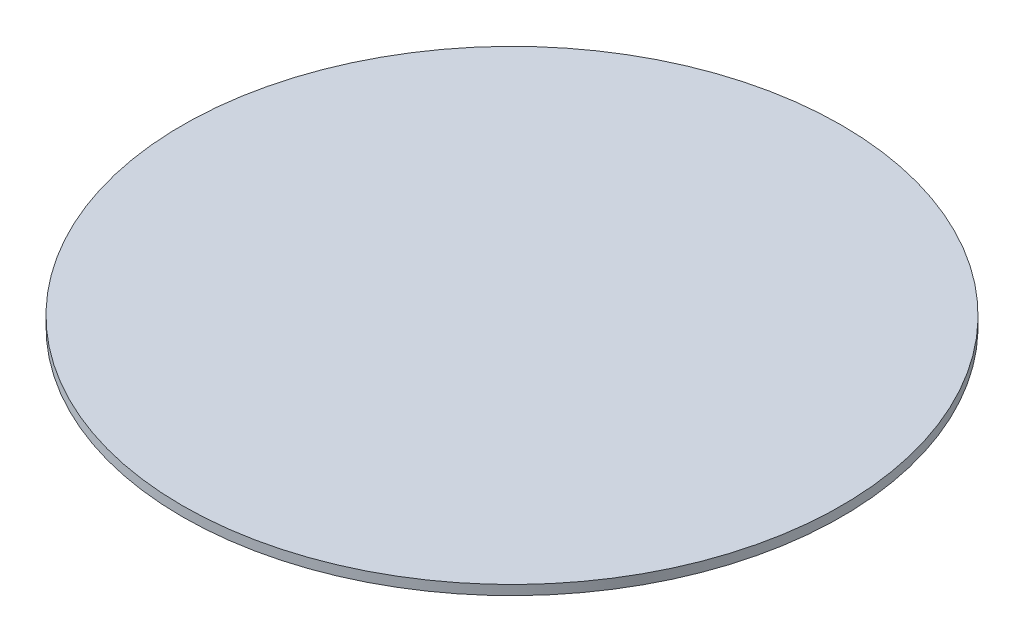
from build123d import *

# Parameters (mm, degrees)
SKETCH1_R           = 37.5
BOSS_EXTRUDE1_DEPTH = 1.1


with BuildPart() as part:
    # Sketch1 → Boss-Extrude1 (new body)
    with BuildSketch(Plane(origin=(0, 0, 0), x_dir=(1, 0, 0), z_dir=(0, 1, 0))):
        with Locations(Location((0, 0, 0), (0, 0, 270))):
            Circle(SKETCH1_R)
    extrude(amount=BOSS_EXTRUDE1_DEPTH)


solid = part.part
